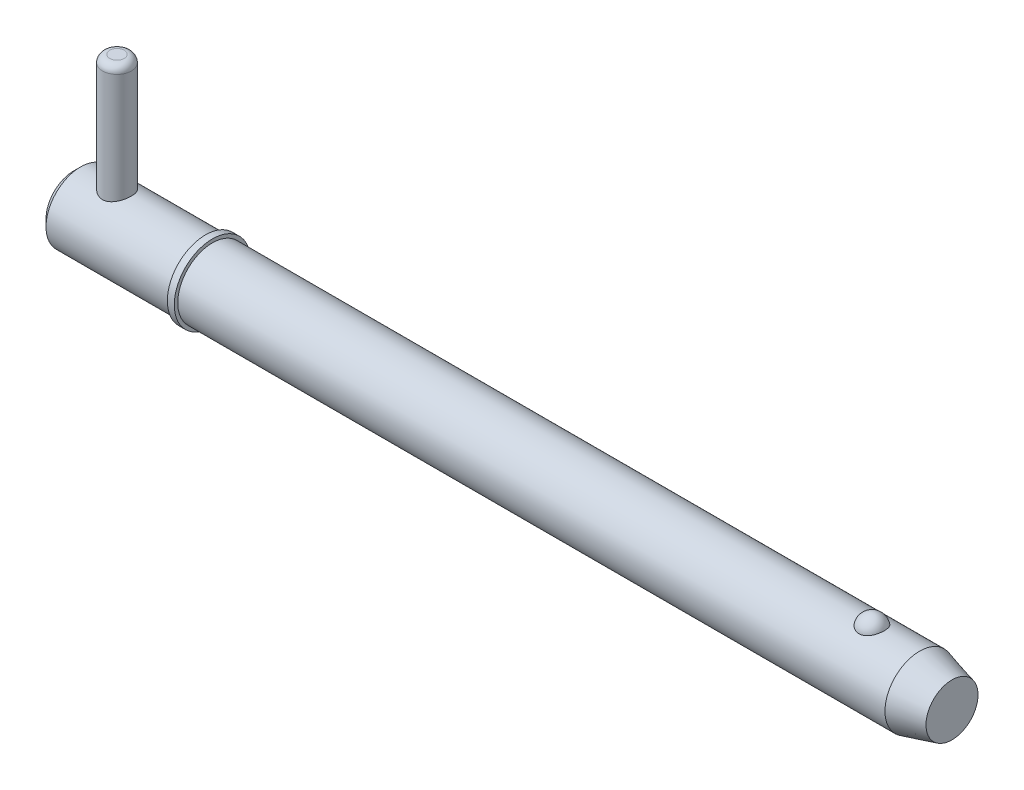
ISO-10303-21;
HEADER;
FILE_DESCRIPTION(('STEP AP214'),'2;1');
FILE_NAME('part.step','',(''),(''),'','','');
FILE_SCHEMA(('AUTOMOTIVE_DESIGN { 1 0 10303 214 1 1 1 1 }'));
ENDSEC;
DATA;
#1=APPLICATION_CONTEXT('core data for automotive mechanical design processes');
#2=APPLICATION_PROTOCOL_DEFINITION('international standard','automotive_design',2000,#1);
#3=PRODUCT_CONTEXT('',#1,'mechanical');
#4=PRODUCT('Part','Part','',(#3));
#5=PRODUCT_RELATED_PRODUCT_CATEGORY('part','',(#4));
#6=PRODUCT_DEFINITION_FORMATION('','',#4);
#7=PRODUCT_DEFINITION_CONTEXT('part definition',#1,'design');
#8=PRODUCT_DEFINITION('design','',#6,#7);
#9=PRODUCT_DEFINITION_SHAPE('','',#8);
#10=(LENGTH_UNIT() NAMED_UNIT(*) SI_UNIT(.MILLI.,.METRE.));
#11=(NAMED_UNIT(*) PLANE_ANGLE_UNIT() SI_UNIT($,.RADIAN.));
#12=(NAMED_UNIT(*) SI_UNIT($,.STERADIAN.) SOLID_ANGLE_UNIT());
#13=UNCERTAINTY_MEASURE_WITH_UNIT(LENGTH_MEASURE(1.E-05),#10,'distance_accuracy_value','');
#14=(GEOMETRIC_REPRESENTATION_CONTEXT(3) GLOBAL_UNCERTAINTY_ASSIGNED_CONTEXT((#13)) GLOBAL_UNIT_ASSIGNED_CONTEXT((#10,
#11,#12)) REPRESENTATION_CONTEXT('',''));
#15=CARTESIAN_POINT('',(0.,0.,0.));
#16=DIRECTION('',(0.,0.,1.));
#17=DIRECTION('',(1.,0.,0.));
#18=AXIS2_PLACEMENT_3D('',#15,#16,#17);
#19=CARTESIAN_POINT('',(5.94,20.635,0.));
#20=DIRECTION('',(0.,-1.,0.));
#21=DIRECTION('',(0.,0.,-1.));
#22=AXIS2_PLACEMENT_3D('',#19,#20,#21);
#23=CYLINDRICAL_SURFACE('',#22,1.98);
#24=CARTESIAN_POINT('',(5.94,-3.775,0.));
#25=DIRECTION('',(0.,1.,0.));
#26=DIRECTION('',(0.,0.,1.));
#27=AXIS2_PLACEMENT_3D('',#24,#25,#26);
#28=CIRCLE('',#27,1.98);
#29=CARTESIAN_POINT('',(5.94,-3.775,1.98));
#30=VERTEX_POINT('',#29);
#31=EDGE_CURVE('P0_E25',#30,#30,#28,.T.);
#32=ORIENTED_EDGE('',*,*,#31,.T.);
#33=EDGE_LOOP('',(#32));
#34=FACE_BOUND('',#33,.T.);
#35=CARTESIAN_POINT('',(5.94,19.645,0.));
#36=DIRECTION('',(0.,1.,0.));
#37=DIRECTION('',(0.,0.,1.));
#38=AXIS2_PLACEMENT_3D('',#35,#36,#37);
#39=CIRCLE('',#38,1.98);
#40=CARTESIAN_POINT('',(5.94,19.645,1.98));
#41=VERTEX_POINT('',#40);
#42=EDGE_CURVE('P0_E29',#41,#41,#39,.F.);
#43=ORIENTED_EDGE('',*,*,#42,.T.);
#44=EDGE_LOOP('',(#43));
#45=FACE_BOUND('',#44,.T.);
#46=ADVANCED_FACE('P0_F14',(#34,#45),#23,.T.);
#47=CARTESIAN_POINT('',(5.94,20.635,0.));
#48=DIRECTION('',(0.,1.,0.));
#49=DIRECTION('',(0.,0.,1.));
#50=AXIS2_PLACEMENT_3D('',#47,#48,#49);
#51=PLANE('',#50);
#52=CARTESIAN_POINT('',(5.94,20.635,0.));
#53=DIRECTION('',(0.,1.,0.));
#54=DIRECTION('',(0.,0.,1.));
#55=AXIS2_PLACEMENT_3D('',#52,#53,#54);
#56=CIRCLE('',#55,0.99);
#57=CARTESIAN_POINT('',(5.94,20.635,0.99));
#58=VERTEX_POINT('',#57);
#59=EDGE_CURVE('P0_E10',#58,#58,#56,.T.);
#60=ORIENTED_EDGE('',*,*,#59,.T.);
#61=EDGE_LOOP('',(#60));
#62=FACE_BOUND('',#61,.T.);
#63=ADVANCED_FACE('P0_F46',(#62),#51,.T.);
#64=CARTESIAN_POINT('',(5.94,-4.765,0.));
#65=DIRECTION('',(0.,1.,0.));
#66=DIRECTION('',(0.,0.,1.));
#67=AXIS2_PLACEMENT_3D('',#64,#65,#66);
#68=PLANE('',#67);
#69=CARTESIAN_POINT('',(5.94,-4.765,0.));
#70=DIRECTION('',(0.,1.,0.));
#71=DIRECTION('',(0.,0.,1.));
#72=AXIS2_PLACEMENT_3D('',#69,#70,#71);
#73=CIRCLE('',#72,0.99);
#74=CARTESIAN_POINT('',(5.94,-4.765,0.99));
#75=VERTEX_POINT('',#74);
#76=EDGE_CURVE('P0_E21',#75,#75,#73,.F.);
#77=ORIENTED_EDGE('',*,*,#76,.T.);
#78=EDGE_LOOP('',(#77));
#79=FACE_BOUND('',#78,.T.);
#80=ADVANCED_FACE('P0_F43',(#79),#68,.F.);
#81=CARTESIAN_POINT('',(5.94,-3.775,0.));
#82=DIRECTION('',(0.,1.,0.));
#83=DIRECTION('',(0.,0.,1.));
#84=AXIS2_PLACEMENT_3D('',#81,#82,#83);
#85=DEGENERATE_TOROIDAL_SURFACE('',#84,0.99,0.99,.T.);
#86=ORIENTED_EDGE('',*,*,#76,.F.);
#87=EDGE_LOOP('',(#86));
#88=FACE_BOUND('',#87,.T.);
#89=ORIENTED_EDGE('',*,*,#31,.F.);
#90=EDGE_LOOP('',(#89));
#91=FACE_BOUND('',#90,.T.);
#92=ADVANCED_FACE('P0_F38',(#88,#91),#85,.T.);
#93=CARTESIAN_POINT('',(5.94,19.645,0.));
#94=DIRECTION('',(0.,1.,0.));
#95=DIRECTION('',(0.,0.,1.));
#96=AXIS2_PLACEMENT_3D('',#93,#94,#95);
#97=DEGENERATE_TOROIDAL_SURFACE('',#96,0.99,0.99,.T.);
#98=ORIENTED_EDGE('',*,*,#42,.F.);
#99=EDGE_LOOP('',(#98));
#100=FACE_BOUND('',#99,.T.);
#101=ORIENTED_EDGE('',*,*,#59,.F.);
#102=EDGE_LOOP('',(#101));
#103=FACE_BOUND('',#102,.T.);
#104=ADVANCED_FACE('P0_F16',(#100,#103),#97,.T.);
#105=CLOSED_SHELL('',(#46,#63,#80,#92,#104));
#106=MANIFOLD_SOLID_BREP('P0_B1',#105);
#107=CARTESIAN_POINT('',(0.,0.,0.));
#108=DIRECTION('',(1.,0.,0.));
#109=DIRECTION('',(0.,0.,-1.));
#110=AXIS2_PLACEMENT_3D('',#107,#108,#109);
#111=CYLINDRICAL_SURFACE('',#110,4.765);
#112=CARTESIAN_POINT('',(116.204194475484,0.,0.));
#113=DIRECTION('',(1.,0.,0.));
#114=DIRECTION('',(0.,0.,-1.));
#115=AXIS2_PLACEMENT_3D('',#112,#113,#114);
#116=CIRCLE('',#115,4.765);
#117=CARTESIAN_POINT('',(116.204194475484,0.,-4.765));
#118=VERTEX_POINT('',#117);
#119=EDGE_CURVE('P1_E81',#118,#118,#116,.T.);
#120=ORIENTED_EDGE('',*,*,#119,.F.);
#121=EDGE_LOOP('',(#120));
#122=FACE_BOUND('',#121,.T.);
#123=CARTESIAN_POINT('',(19.05,0.,0.));
#124=DIRECTION('',(1.,0.,0.));
#125=DIRECTION('',(0.,0.,-1.));
#126=AXIS2_PLACEMENT_3D('',#123,#124,#125);
#127=CIRCLE('',#126,4.765);
#128=CARTESIAN_POINT('',(19.05,0.,-4.765));
#129=VERTEX_POINT('',#128);
#130=EDGE_CURVE('P1_E85',#129,#129,#127,.T.);
#131=ORIENTED_EDGE('',*,*,#130,.T.);
#132=EDGE_LOOP('',(#131));
#133=FACE_BOUND('',#132,.T.);
#134=CARTESIAN_POINT('',(109.651020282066,4.42764777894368,1.76101111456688));
#135=CARTESIAN_POINT('',(109.559721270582,4.42764470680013,1.76101422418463));
#136=CARTESIAN_POINT('',(109.468446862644,4.43059091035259,1.75366340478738));
#137=CARTESIAN_POINT('',(109.288615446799,4.44201846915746,1.72451180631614));
#138=CARTESIAN_POINT('',(109.200057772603,4.45049845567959,1.70271460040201));
#139=CARTESIAN_POINT('',(109.028257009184,4.47200516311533,1.6453937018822));
#140=CARTESIAN_POINT('',(108.945006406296,4.48502527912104,1.60988994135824));
#141=CARTESIAN_POINT('',(108.785763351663,4.51419542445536,1.52617873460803));
#142=CARTESIAN_POINT('',(108.709772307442,4.53034605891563,1.47796883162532));
#143=CARTESIAN_POINT('',(108.564744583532,4.5645931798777,1.36860494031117));
#144=CARTESIAN_POINT('',(108.495964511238,4.58273170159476,1.30712420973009));
#145=CARTESIAN_POINT('',(108.369342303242,4.61870302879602,1.17370204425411));
#146=CARTESIAN_POINT('',(108.311502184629,4.63653577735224,1.10175868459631));
#147=CARTESIAN_POINT('',(108.205570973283,4.67090140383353,0.945806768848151));
#148=CARTESIAN_POINT('',(108.158030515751,4.68734068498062,0.861402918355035));
#149=CARTESIAN_POINT('',(108.077081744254,4.71628466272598,0.685442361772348));
#150=CARTESIAN_POINT('',(108.043674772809,4.72878898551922,0.593884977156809));
#151=CARTESIAN_POINT('',(107.991287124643,4.74874061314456,0.404781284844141));
#152=CARTESIAN_POINT('',(107.972517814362,4.75611366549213,0.307168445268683));
#153=CARTESIAN_POINT('',(107.950584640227,4.76475393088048,0.109940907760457));
#154=CARTESIAN_POINT('',(107.947420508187,4.76602124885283,0.0103262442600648));
#155=CARTESIAN_POINT('',(107.956740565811,4.76232928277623,-0.187629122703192));
#156=CARTESIAN_POINT('',(107.969158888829,4.7573962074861,-0.285973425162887));
#157=CARTESIAN_POINT('',(108.009280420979,4.74184975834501,-0.479027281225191));
#158=CARTESIAN_POINT('',(108.036983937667,4.7312362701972,-0.573736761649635));
#159=CARTESIAN_POINT('',(108.107158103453,4.70540026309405,-0.756973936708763));
#160=CARTESIAN_POINT('',(108.149646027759,4.69017235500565,-0.845494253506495));
#161=CARTESIAN_POINT('',(108.248520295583,4.6566986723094,-1.01378033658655));
#162=CARTESIAN_POINT('',(108.304907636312,4.63845268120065,-1.09354547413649));
#163=CARTESIAN_POINT('',(108.430552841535,4.60085438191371,-1.24228523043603));
#164=CARTESIAN_POINT('',(108.499843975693,4.58149930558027,-1.31123108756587));
#165=CARTESIAN_POINT('',(108.649606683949,4.54391653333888,-1.43607409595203));
#166=CARTESIAN_POINT('',(108.730077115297,4.52568872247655,-1.49197257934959));
#167=CARTESIAN_POINT('',(108.898150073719,4.49293007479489,-1.58786764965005));
#168=CARTESIAN_POINT('',(108.985544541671,4.47832346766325,-1.62820219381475));
#169=CARTESIAN_POINT('',(109.166553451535,4.45406011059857,-1.69345757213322));
#170=CARTESIAN_POINT('',(109.26016555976,4.44440151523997,-1.71838415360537));
#171=CARTESIAN_POINT('',(109.445893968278,4.43159888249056,-1.75112843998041));
#172=CARTESIAN_POINT('',(109.537849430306,4.42815213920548,-1.75974223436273));
#173=CARTESIAN_POINT('',(109.721965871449,4.427247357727,-1.76201865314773));
#174=CARTESIAN_POINT('',(109.814126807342,4.42978816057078,-1.7556841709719));
#175=CARTESIAN_POINT('',(109.993129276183,4.4403864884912,-1.72869560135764));
#176=CARTESIAN_POINT('',(110.080047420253,4.44827555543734,-1.70847853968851));
#177=CARTESIAN_POINT('',(110.249131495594,4.46852246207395,-1.65479562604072));
#178=CARTESIAN_POINT('',(110.331297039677,4.48088066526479,-1.62132869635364));
#179=CARTESIAN_POINT('',(110.490591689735,4.50907357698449,-1.54120560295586));
#180=CARTESIAN_POINT('',(110.567570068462,4.52497884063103,-1.49427526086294));
#181=CARTESIAN_POINT('',(110.712708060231,4.55845148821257,-1.38881222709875));
#182=CARTESIAN_POINT('',(110.780865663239,4.57601924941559,-1.33027689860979));
#183=CARTESIAN_POINT('',(110.910099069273,4.61196537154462,-1.19991049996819));
#184=CARTESIAN_POINT('',(110.970656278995,4.63034074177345,-1.12756415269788));
#185=CARTESIAN_POINT('',(111.079279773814,4.66513959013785,-0.973612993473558));
#186=CARTESIAN_POINT('',(111.127343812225,4.68156271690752,-0.892006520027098));
#187=CARTESIAN_POINT('',(111.211383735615,4.71130224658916,-0.718892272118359));
#188=CARTESIAN_POINT('',(111.246918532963,4.724501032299,-0.627149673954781));
#189=CARTESIAN_POINT('',(111.302952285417,4.74571823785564,-0.438611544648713));
#190=CARTESIAN_POINT('',(111.323450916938,4.75373654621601,-0.341815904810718));
#191=CARTESIAN_POINT('',(111.349033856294,4.76378905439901,-0.145633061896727));
#192=CARTESIAN_POINT('',(111.354076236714,4.76580697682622,-0.0462395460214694));
#193=CARTESIAN_POINT('',(111.348523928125,4.76360573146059,0.152038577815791));
#194=CARTESIAN_POINT('',(111.337929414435,4.75938663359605,0.250923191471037));
#195=CARTESIAN_POINT('',(111.301387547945,4.74516937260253,0.445004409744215));
#196=CARTESIAN_POINT('',(111.275496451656,4.73519238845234,0.540213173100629));
#197=CARTESIAN_POINT('',(111.208927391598,4.7104939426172,0.724662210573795));
#198=CARTESIAN_POINT('',(111.168248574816,4.69577220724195,0.813902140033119));
#199=CARTESIAN_POINT('',(111.072717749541,4.66303767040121,0.984313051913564));
#200=CARTESIAN_POINT('',(111.017804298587,4.64501070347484,1.06544688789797));
#201=CARTESIAN_POINT('',(110.895049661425,4.60764678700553,1.21692673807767));
#202=CARTESIAN_POINT('',(110.827208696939,4.58830985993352,1.2872729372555));
#203=CARTESIAN_POINT('',(110.680548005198,4.55060370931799,1.41479271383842));
#204=CARTESIAN_POINT('',(110.601791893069,4.53222967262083,1.4720378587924));
#205=CARTESIAN_POINT('',(110.434989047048,4.49849576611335,1.57212016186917));
#206=CARTESIAN_POINT('',(110.346941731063,4.48313608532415,1.61495641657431));
#207=CARTESIAN_POINT('',(110.159791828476,4.45676184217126,1.68642657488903));
#208=CARTESIAN_POINT('',(110.060365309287,4.44598302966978,1.71430590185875));
#209=CARTESIAN_POINT('',(109.857621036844,4.43142918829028,1.75159258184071));
#210=CARTESIAN_POINT('',(109.754304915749,4.42765125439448,1.76100759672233));
#211=CARTESIAN_POINT('',(109.651020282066,4.42764777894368,1.76101111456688));
#212=B_SPLINE_CURVE_WITH_KNOTS('',3,(#134,#135,#136,#137,#138,#139,#140,#141,#142,#143,#144,
#145,#146,#147,#148,#149,#150,#151,#152,#153,#154,#155,#156,#157,#158,#159,#160,#161,#162,#163,
#164,#165,#166,#167,#168,#169,#170,#171,#172,#173,#174,#175,#176,#177,#178,#179,#180,#181,#182,
#183,#184,#185,#186,#187,#188,#189,#190,#191,#192,#193,#194,#195,#196,#197,#198,#199,#200,#201,
#202,#203,#204,#205,#206,#207,#208,#209,#210,#211),.UNSPECIFIED.,.T.,.F.,(4,2,2,2,2,2,2,2,2,2,2,
2,2,2,2,2,2,2,2,2,2,2,2,2,2,2,2,2,2,2,2,2,2,2,2,2,2,2,4),(0.,0.273517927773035,
0.546968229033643,0.820022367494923,1.09312934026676,1.37393946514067,1.65480131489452,
1.94820420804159,2.24163496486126,2.53922817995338,2.8368162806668,3.13315071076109,
3.42949110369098,3.72617893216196,4.02288805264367,4.32037303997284,4.61782764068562,
4.90840095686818,5.19886582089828,5.4747485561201,5.75057789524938,6.01809977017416,
6.2856434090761,6.55907787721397,6.83257454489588,7.11962987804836,7.40673679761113,
7.70312663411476,7.99952284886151,8.29672237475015,8.59391856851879,8.89002850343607,
9.18615552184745,9.483582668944,9.78100471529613,10.0767610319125,10.3725358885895,
10.6820893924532,10.991514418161),.UNSPECIFIED.);
#213=CARTESIAN_POINT('',(109.651020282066,4.42764777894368,1.76101111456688));
#214=VERTEX_POINT('',#213);
#215=EDGE_CURVE('P1_E35',#214,#214,#212,.T.);
#216=ORIENTED_EDGE('',*,*,#215,.T.);
#217=EDGE_LOOP('',(#216));
#218=FACE_BOUND('',#217,.T.);
#219=ADVANCED_FACE('P1_F13',(#122,#133,#218),#111,.T.);
#220=CARTESIAN_POINT('',(0.,0.,0.));
#221=DIRECTION('',(-1.,0.,0.));
#222=DIRECTION('',(0.,0.,1.));
#223=AXIS2_PLACEMENT_3D('',#220,#221,#222);
#224=PLANE('',#223);
#225=CARTESIAN_POINT('',(0.,0.,0.));
#226=DIRECTION('',(1.,0.,0.));
#227=DIRECTION('',(0.,0.,-1.));
#228=AXIS2_PLACEMENT_3D('',#225,#226,#227);
#229=CIRCLE('',#228,3.812);
#230=CARTESIAN_POINT('',(0.,0.,-3.812));
#231=VERTEX_POINT('',#230);
#232=EDGE_CURVE('P1_E9',#231,#231,#229,.T.);
#233=ORIENTED_EDGE('',*,*,#232,.F.);
#234=EDGE_LOOP('',(#233));
#235=FACE_BOUND('',#234,.T.);
#236=ADVANCED_FACE('P1_F15',(#235),#224,.T.);
#237=CARTESIAN_POINT('',(0.952999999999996,0.,0.));
#238=DIRECTION('',(1.,0.,0.));
#239=DIRECTION('',(0.,0.,-1.));
#240=AXIS2_PLACEMENT_3D('',#237,#238,#239);
#241=CONICAL_SURFACE('',#240,4.765,0.78539816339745);
#242=ORIENTED_EDGE('',*,*,#232,.T.);
#243=EDGE_LOOP('',(#242));
#244=FACE_BOUND('',#243,.T.);
#245=CARTESIAN_POINT('',(0.952999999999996,0.,0.));
#246=DIRECTION('',(1.,0.,0.));
#247=DIRECTION('',(0.,0.,-1.));
#248=AXIS2_PLACEMENT_3D('',#245,#246,#247);
#249=CIRCLE('',#248,4.765);
#250=CARTESIAN_POINT('',(0.952999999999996,0.,-4.765));
#251=VERTEX_POINT('',#250);
#252=EDGE_CURVE('P1_E26',#251,#251,#249,.T.);
#253=ORIENTED_EDGE('',*,*,#252,.F.);
#254=EDGE_LOOP('',(#253));
#255=FACE_BOUND('',#254,.T.);
#256=ADVANCED_FACE('P1_F77',(#244,#255),#241,.T.);
#257=CARTESIAN_POINT('',(0.,0.,0.));
#258=DIRECTION('',(1.,0.,0.));
#259=DIRECTION('',(0.,0.,-1.));
#260=AXIS2_PLACEMENT_3D('',#257,#258,#259);
#261=CYLINDRICAL_SURFACE('',#260,4.765);
#262=CARTESIAN_POINT('',(5.94,-4.33414639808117,1.98));
#263=CARTESIAN_POINT('',(5.83435484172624,-4.33415447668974,1.97999169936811));
#264=CARTESIAN_POINT('',(5.72854887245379,-4.33806396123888,1.97149330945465));
#265=CARTESIAN_POINT('',(5.51998191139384,-4.35319906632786,1.93783487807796));
#266=CARTESIAN_POINT('',(5.41723000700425,-4.3644446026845,1.91262947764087));
#267=CARTESIAN_POINT('',(5.21817294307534,-4.39274225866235,1.84670269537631));
#268=CARTESIAN_POINT('',(5.12184344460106,-4.40977076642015,1.80604432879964));
#269=CARTESIAN_POINT('',(4.93740039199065,-4.44768106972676,1.71055160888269));
#270=CARTESIAN_POINT('',(4.84928487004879,-4.46856193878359,1.65572066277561));
#271=CARTESIAN_POINT('',(4.67826533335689,-4.51326966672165,1.52981120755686));
#272=CARTESIAN_POINT('',(4.59593118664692,-4.53719608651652,1.45799365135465));
#273=CARTESIAN_POINT('',(4.44405452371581,-4.58448035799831,1.30170177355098));
#274=CARTESIAN_POINT('',(4.37451692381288,-4.60783798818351,1.21722260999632));
#275=CARTESIAN_POINT('',(4.24730683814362,-4.65256187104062,1.03353484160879));
#276=CARTESIAN_POINT('',(4.19027484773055,-4.67379892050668,0.933848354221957));
#277=CARTESIAN_POINT('',(4.0940363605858,-4.7106711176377,0.7252544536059));
#278=CARTESIAN_POINT('',(4.05482199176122,-4.72630873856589,0.61635113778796));
#279=CARTESIAN_POINT('',(3.99739515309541,-4.74951416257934,0.398397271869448));
#280=CARTESIAN_POINT('',(3.97820018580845,-4.7574579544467,0.289646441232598));
#281=CARTESIAN_POINT('',(3.95818309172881,-4.76574596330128,0.0701967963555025));
#282=CARTESIAN_POINT('',(3.95735355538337,-4.76609324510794,-0.0405012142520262));
#283=CARTESIAN_POINT('',(3.9735743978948,-4.75937098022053,-0.253561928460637));
#284=CARTESIAN_POINT('',(3.98954548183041,-4.75274912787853,-0.356023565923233));
#285=CARTESIAN_POINT('',(4.03706504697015,-4.73344665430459,-0.556659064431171));
#286=CARTESIAN_POINT('',(4.06861467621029,-4.72076558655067,-0.654832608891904));
#287=CARTESIAN_POINT('',(4.14677192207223,-4.69032846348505,-0.845904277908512));
#288=CARTESIAN_POINT('',(4.19360181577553,-4.67249797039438,-0.938699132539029));
#289=CARTESIAN_POINT('',(4.30077315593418,-4.63350852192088,-1.11535616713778));
#290=CARTESIAN_POINT('',(4.3611193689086,-4.61234839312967,-1.19921518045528));
#291=CARTESIAN_POINT('',(4.49853487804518,-4.56707259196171,-1.3618711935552));
#292=CARTESIAN_POINT('',(4.57648039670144,-4.5428537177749,-1.43990029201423));
#293=CARTESIAN_POINT('',(4.74440779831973,-4.49530722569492,-1.58211009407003));
#294=CARTESIAN_POINT('',(4.83439425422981,-4.47197995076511,-1.64628551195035));
#295=CARTESIAN_POINT('',(5.02755026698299,-4.42812342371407,-1.76092221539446));
#296=CARTESIAN_POINT('',(5.13105348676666,-4.40770990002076,-1.81086937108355));
#297=CARTESIAN_POINT('',(5.34607555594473,-4.37336901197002,-1.89231211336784));
#298=CARTESIAN_POINT('',(5.45758864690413,-4.3594370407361,-1.92382080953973));
#299=CARTESIAN_POINT('',(5.67777275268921,-4.34077746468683,-1.96554536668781));
#300=CARTESIAN_POINT('',(5.78616167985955,-4.33551319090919,-1.9770057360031));
#301=CARTESIAN_POINT('',(6.00341835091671,-4.33325118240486,-1.98196183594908));
#302=CARTESIAN_POINT('',(6.11228591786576,-4.33625061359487,-1.97546372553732));
#303=CARTESIAN_POINT('',(6.32012423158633,-4.34962383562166,-1.94582288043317));
#304=CARTESIAN_POINT('',(6.41928436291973,-4.35951709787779,-1.92376364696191));
#305=CARTESIAN_POINT('',(6.61241543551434,-4.38495043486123,-1.86506038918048));
#306=CARTESIAN_POINT('',(6.70638516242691,-4.40049182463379,-1.82841296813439));
#307=CARTESIAN_POINT('',(6.89090272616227,-4.43627016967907,-1.73985559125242));
#308=CARTESIAN_POINT('',(6.98113841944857,-4.45667771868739,-1.68736639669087));
#309=CARTESIAN_POINT('',(7.1519532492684,-4.49964530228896,-1.56919282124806));
#310=CARTESIAN_POINT('',(7.232528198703,-4.52220626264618,-1.50350275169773));
#311=CARTESIAN_POINT('',(7.38851617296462,-4.56914071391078,-1.35452895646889));
#312=CARTESIAN_POINT('',(7.46298462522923,-4.5935132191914,-1.27025197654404));
#313=CARTESIAN_POINT('',(7.59689029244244,-4.63962841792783,-1.08983181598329));
#314=CARTESIAN_POINT('',(7.65632644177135,-4.66137092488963,-0.993687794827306));
#315=CARTESIAN_POINT('',(7.75840361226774,-4.69991192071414,-0.791608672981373));
#316=CARTESIAN_POINT('',(7.80100481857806,-4.71669866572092,-0.685651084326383));
#317=CARTESIAN_POINT('',(7.86746997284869,-4.74331408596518,-0.467197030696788));
#318=CARTESIAN_POINT('',(7.8913450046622,-4.75314687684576,-0.354704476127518));
#319=CARTESIAN_POINT('',(7.91828971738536,-4.76427543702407,-0.134819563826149));
#320=CARTESIAN_POINT('',(7.92269147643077,-4.76611762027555,-0.027616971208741));
#321=CARTESIAN_POINT('',(7.91414154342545,-4.76256684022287,0.185959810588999));
#322=CARTESIAN_POINT('',(7.90119286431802,-4.75717513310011,0.292334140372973));
#323=CARTESIAN_POINT('',(7.85926572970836,-4.74004856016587,0.497383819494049));
#324=CARTESIAN_POINT('',(7.83086647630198,-4.72854322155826,0.596198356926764));
#325=CARTESIAN_POINT('',(7.75947503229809,-4.70045111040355,0.787624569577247));
#326=CARTESIAN_POINT('',(7.71648006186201,-4.68386336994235,0.880235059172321));
#327=CARTESIAN_POINT('',(7.6149456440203,-4.64628321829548,1.06122875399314));
#328=CARTESIAN_POINT('',(7.55579211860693,-4.62512577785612,1.14923242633));
#329=CARTESIAN_POINT('',(7.42451813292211,-4.58091700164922,1.31443888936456));
#330=CARTESIAN_POINT('',(7.35239289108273,-4.5578649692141,1.39163767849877));
#331=CARTESIAN_POINT('',(7.19146107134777,-4.51050832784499,1.53847013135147));
#332=CARTESIAN_POINT('',(7.10185635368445,-4.48622440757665,1.60723941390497));
#333=CARTESIAN_POINT('',(6.91164948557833,-4.44076541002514,1.72888900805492));
#334=CARTESIAN_POINT('',(6.81104124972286,-4.41959206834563,1.78176046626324));
#335=CARTESIAN_POINT('',(6.60181953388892,-4.38318936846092,1.86953227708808));
#336=CARTESIAN_POINT('',(6.49325511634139,-4.3679267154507,1.90453365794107));
#337=CARTESIAN_POINT('',(6.32681512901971,-4.35102038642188,1.94268459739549));
#338=CARTESIAN_POINT('',(6.27079191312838,-4.34638447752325,1.953006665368));
#339=CARTESIAN_POINT('',(6.15793999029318,-4.33925923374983,1.96879053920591));
#340=CARTESIAN_POINT('',(6.10111188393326,-4.33676837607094,1.97425579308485));
#341=CARTESIAN_POINT('',(6.00947316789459,-4.33456308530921,1.97908711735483));
#342=CARTESIAN_POINT('',(5.97474528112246,-4.33414374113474,1.98000272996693));
#343=CARTESIAN_POINT('',(5.94,-4.33414639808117,1.98));
#344=B_SPLINE_CURVE_WITH_KNOTS('',3,(#262,#263,#264,#265,#266,#267,#268,#269,#270,#271,#272,
#273,#274,#275,#276,#277,#278,#279,#280,#281,#282,#283,#284,#285,#286,#287,#288,#289,#290,#291,
#292,#293,#294,#295,#296,#297,#298,#299,#300,#301,#302,#303,#304,#305,#306,#307,#308,#309,#310,
#311,#312,#313,#314,#315,#316,#317,#318,#319,#320,#321,#322,#323,#324,#325,#326,#327,#328,#329,
#330,#331,#332,#333,#334,#335,#336,#337,#338,#339,#340,#341,#342,#343),.UNSPECIFIED.,.T.,.F.,(4,
2,2,2,2,2,2,2,2,2,2,2,2,2,2,2,2,2,2,2,2,2,2,2,2,2,2,2,2,2,2,2,2,2,2,2,2,2,2,2,4),(0.,
0.316814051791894,0.634491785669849,0.950887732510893,1.2672076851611,1.60127705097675,
1.93547449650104,2.28407463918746,2.63252061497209,2.96292077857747,3.29318763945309,
3.60346227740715,3.91375978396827,4.22878888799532,4.54392926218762,4.88117914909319,
5.21855748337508,5.56691259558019,5.91501972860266,6.24062939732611,6.56612741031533,
6.87094948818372,7.17584258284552,7.49361276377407,7.81152017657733,8.15513975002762,
8.4987836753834,8.8432355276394,9.18748334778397,9.50777781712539,9.8280166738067,
10.1370037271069,10.4460496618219,10.7690461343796,11.0921619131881,11.4371238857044,
11.7822776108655,12.1254577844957,12.2967183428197,12.4678572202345,12.5720531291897),.UNSPECIFIED.);
#345=CARTESIAN_POINT('',(5.94,-4.33414639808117,1.98));
#346=VERTEX_POINT('',#345);
#347=EDGE_CURVE('P1_E17',#346,#346,#344,.T.);
#348=ORIENTED_EDGE('',*,*,#347,.F.);
#349=EDGE_LOOP('',(#348));
#350=FACE_BOUND('',#349,.T.);
#351=CARTESIAN_POINT('',(5.94,4.33414639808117,1.98));
#352=CARTESIAN_POINT('',(6.04564515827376,4.33415447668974,1.97999169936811));
#353=CARTESIAN_POINT('',(6.15145112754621,4.33806396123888,1.97149330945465));
#354=CARTESIAN_POINT('',(6.36001808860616,4.35319906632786,1.93783487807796));
#355=CARTESIAN_POINT('',(6.46276999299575,4.3644446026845,1.91262947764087));
#356=CARTESIAN_POINT('',(6.66182705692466,4.39274225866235,1.84670269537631));
#357=CARTESIAN_POINT('',(6.75815655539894,4.40977076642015,1.80604432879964));
#358=CARTESIAN_POINT('',(6.94259960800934,4.44768106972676,1.71055160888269));
#359=CARTESIAN_POINT('',(7.03071512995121,4.46856193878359,1.65572066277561));
#360=CARTESIAN_POINT('',(7.20173466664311,4.51326966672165,1.52981120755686));
#361=CARTESIAN_POINT('',(7.28406881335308,4.53719608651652,1.45799365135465));
#362=CARTESIAN_POINT('',(7.43594547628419,4.58448035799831,1.30170177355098));
#363=CARTESIAN_POINT('',(7.50548307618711,4.60783798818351,1.21722260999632));
#364=CARTESIAN_POINT('',(7.63269316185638,4.65256187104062,1.03353484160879));
#365=CARTESIAN_POINT('',(7.68972515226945,4.67379892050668,0.933848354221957));
#366=CARTESIAN_POINT('',(7.7859636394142,4.7106711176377,0.7252544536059));
#367=CARTESIAN_POINT('',(7.82517800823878,4.72630873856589,0.61635113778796));
#368=CARTESIAN_POINT('',(7.88260484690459,4.74951416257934,0.398397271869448));
#369=CARTESIAN_POINT('',(7.90179981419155,4.7574579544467,0.289646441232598));
#370=CARTESIAN_POINT('',(7.92181690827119,4.76574596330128,0.0701967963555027));
#371=CARTESIAN_POINT('',(7.92264644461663,4.76609324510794,-0.040501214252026));
#372=CARTESIAN_POINT('',(7.9064256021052,4.75937098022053,-0.253561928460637));
#373=CARTESIAN_POINT('',(7.89045451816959,4.75274912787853,-0.356023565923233));
#374=CARTESIAN_POINT('',(7.84293495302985,4.73344665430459,-0.55665906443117));
#375=CARTESIAN_POINT('',(7.81138532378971,4.72076558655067,-0.654832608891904));
#376=CARTESIAN_POINT('',(7.73322807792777,4.69032846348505,-0.845904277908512));
#377=CARTESIAN_POINT('',(7.68639818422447,4.67249797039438,-0.938699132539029));
#378=CARTESIAN_POINT('',(7.57922684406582,4.63350852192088,-1.11535616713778));
#379=CARTESIAN_POINT('',(7.5188806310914,4.61234839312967,-1.19921518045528));
#380=CARTESIAN_POINT('',(7.38146512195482,4.56707259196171,-1.3618711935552));
#381=CARTESIAN_POINT('',(7.30351960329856,4.5428537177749,-1.43990029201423));
#382=CARTESIAN_POINT('',(7.13559220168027,4.49530722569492,-1.58211009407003));
#383=CARTESIAN_POINT('',(7.04560574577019,4.47197995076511,-1.64628551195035));
#384=CARTESIAN_POINT('',(6.85244973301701,4.42812342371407,-1.76092221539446));
#385=CARTESIAN_POINT('',(6.74894651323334,4.40770990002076,-1.81086937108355));
#386=CARTESIAN_POINT('',(6.53392444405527,4.37336901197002,-1.89231211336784));
#387=CARTESIAN_POINT('',(6.42241135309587,4.3594370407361,-1.92382080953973));
#388=CARTESIAN_POINT('',(6.20222724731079,4.34077746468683,-1.96554536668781));
#389=CARTESIAN_POINT('',(6.09383832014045,4.33551319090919,-1.9770057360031));
#390=CARTESIAN_POINT('',(5.87658164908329,4.33325118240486,-1.98196183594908));
#391=CARTESIAN_POINT('',(5.76771408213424,4.33625061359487,-1.97546372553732));
#392=CARTESIAN_POINT('',(5.55987576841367,4.34962383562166,-1.94582288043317));
#393=CARTESIAN_POINT('',(5.46071563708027,4.35951709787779,-1.92376364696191));
#394=CARTESIAN_POINT('',(5.26758456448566,4.38495043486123,-1.86506038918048));
#395=CARTESIAN_POINT('',(5.17361483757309,4.40049182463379,-1.82841296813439));
#396=CARTESIAN_POINT('',(4.98909727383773,4.43627016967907,-1.73985559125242));
#397=CARTESIAN_POINT('',(4.89886158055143,4.45667771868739,-1.68736639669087));
#398=CARTESIAN_POINT('',(4.72804675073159,4.49964530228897,-1.56919282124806));
#399=CARTESIAN_POINT('',(4.647471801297,4.52220626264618,-1.50350275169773));
#400=CARTESIAN_POINT('',(4.49148382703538,4.56914071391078,-1.35452895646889));
#401=CARTESIAN_POINT('',(4.41701537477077,4.5935132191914,-1.27025197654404));
#402=CARTESIAN_POINT('',(4.28310970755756,4.63962841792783,-1.08983181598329));
#403=CARTESIAN_POINT('',(4.22367355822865,4.66137092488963,-0.993687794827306));
#404=CARTESIAN_POINT('',(4.12159638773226,4.69991192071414,-0.791608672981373));
#405=CARTESIAN_POINT('',(4.07899518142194,4.71669866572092,-0.685651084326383));
#406=CARTESIAN_POINT('',(4.01253002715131,4.74331408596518,-0.467197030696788));
#407=CARTESIAN_POINT('',(3.98865499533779,4.75314687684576,-0.354704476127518));
#408=CARTESIAN_POINT('',(3.96171028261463,4.76427543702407,-0.134819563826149));
#409=CARTESIAN_POINT('',(3.95730852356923,4.76611762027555,-0.0276169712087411));
#410=CARTESIAN_POINT('',(3.96585845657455,4.76256684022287,0.185959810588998));
#411=CARTESIAN_POINT('',(3.97880713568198,4.75717513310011,0.292334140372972));
#412=CARTESIAN_POINT('',(4.02073427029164,4.74004856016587,0.497383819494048));
#413=CARTESIAN_POINT('',(4.04913352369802,4.72854322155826,0.596198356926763));
#414=CARTESIAN_POINT('',(4.12052496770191,4.70045111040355,0.787624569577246));
#415=CARTESIAN_POINT('',(4.16351993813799,4.68386336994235,0.880235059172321));
#416=CARTESIAN_POINT('',(4.2650543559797,4.64628321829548,1.06122875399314));
#417=CARTESIAN_POINT('',(4.32420788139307,4.62512577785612,1.14923242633));
#418=CARTESIAN_POINT('',(4.45548186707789,4.58091700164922,1.31443888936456));
#419=CARTESIAN_POINT('',(4.52760710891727,4.5578649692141,1.39163767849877));
#420=CARTESIAN_POINT('',(4.68853892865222,4.51050832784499,1.53847013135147));
#421=CARTESIAN_POINT('',(4.77814364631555,4.48622440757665,1.60723941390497));
#422=CARTESIAN_POINT('',(4.96835051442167,4.44076541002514,1.72888900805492));
#423=CARTESIAN_POINT('',(5.06895875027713,4.41959206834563,1.78176046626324));
#424=CARTESIAN_POINT('',(5.27818046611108,4.38318936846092,1.86953227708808));
#425=CARTESIAN_POINT('',(5.38674488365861,4.3679267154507,1.90453365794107));
#426=CARTESIAN_POINT('',(5.55318487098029,4.35102038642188,1.94268459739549));
#427=CARTESIAN_POINT('',(5.60920808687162,4.34638447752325,1.953006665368));
#428=CARTESIAN_POINT('',(5.72206000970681,4.33925923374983,1.96879053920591));
#429=CARTESIAN_POINT('',(5.77888811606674,4.33676837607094,1.97425579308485));
#430=CARTESIAN_POINT('',(5.87052683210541,4.33456308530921,1.97908711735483));
#431=CARTESIAN_POINT('',(5.90525471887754,4.33414374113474,1.98000272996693));
#432=CARTESIAN_POINT('',(5.94,4.33414639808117,1.98));
#433=B_SPLINE_CURVE_WITH_KNOTS('',3,(#351,#352,#353,#354,#355,#356,#357,#358,#359,#360,#361,
#362,#363,#364,#365,#366,#367,#368,#369,#370,#371,#372,#373,#374,#375,#376,#377,#378,#379,#380,
#381,#382,#383,#384,#385,#386,#387,#388,#389,#390,#391,#392,#393,#394,#395,#396,#397,#398,#399,
#400,#401,#402,#403,#404,#405,#406,#407,#408,#409,#410,#411,#412,#413,#414,#415,#416,#417,#418,
#419,#420,#421,#422,#423,#424,#425,#426,#427,#428,#429,#430,#431,#432),.UNSPECIFIED.,.T.,.F.,(4,
2,2,2,2,2,2,2,2,2,2,2,2,2,2,2,2,2,2,2,2,2,2,2,2,2,2,2,2,2,2,2,2,2,2,2,2,2,2,2,4),(0.,
0.316814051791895,0.634491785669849,0.950887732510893,1.2672076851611,1.60127705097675,
1.93547449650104,2.28407463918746,2.63252061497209,2.96292077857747,3.29318763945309,
3.60346227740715,3.91375978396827,4.22878888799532,4.54392926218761,4.88117914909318,
5.21855748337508,5.56691259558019,5.91501972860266,6.24062939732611,6.56612741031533,
6.87094948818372,7.17584258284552,7.49361276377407,7.81152017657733,8.15513975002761,
8.4987836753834,8.84323552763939,9.18748334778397,9.50777781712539,9.8280166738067,
10.1370037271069,10.4460496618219,10.7690461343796,11.0921619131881,11.4371238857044,
11.7822776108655,12.1254577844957,12.2967183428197,12.4678572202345,12.5720531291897),.UNSPECIFIED.);
#434=CARTESIAN_POINT('',(5.94,4.33414639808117,1.98));
#435=VERTEX_POINT('',#434);
#436=EDGE_CURVE('P1_E43',#435,#435,#433,.T.);
#437=ORIENTED_EDGE('',*,*,#436,.F.);
#438=EDGE_LOOP('',(#437));
#439=FACE_BOUND('',#438,.T.);
#440=ORIENTED_EDGE('',*,*,#252,.T.);
#441=EDGE_LOOP('',(#440));
#442=FACE_BOUND('',#441,.T.);
#443=CARTESIAN_POINT('',(18.097,0.,0.));
#444=DIRECTION('',(1.,0.,0.));
#445=DIRECTION('',(0.,0.,-1.));
#446=AXIS2_PLACEMENT_3D('',#443,#444,#445);
#447=CIRCLE('',#446,4.765);
#448=CARTESIAN_POINT('',(18.097,0.,-4.765));
#449=VERTEX_POINT('',#448);
#450=EDGE_CURVE('P1_E31',#449,#449,#447,.T.);
#451=ORIENTED_EDGE('',*,*,#450,.F.);
#452=EDGE_LOOP('',(#451));
#453=FACE_BOUND('',#452,.T.);
#454=ADVANCED_FACE('P1_F103',(#350,#439,#442,#453),#261,.T.);
#455=CARTESIAN_POINT('',(18.097,4.765,0.));
#456=DIRECTION('',(-1.,0.,0.));
#457=DIRECTION('',(0.,0.,1.));
#458=AXIS2_PLACEMENT_3D('',#455,#456,#457);
#459=PLANE('',#458);
#460=ORIENTED_EDGE('',*,*,#450,.T.);
#461=EDGE_LOOP('',(#460));
#462=FACE_BOUND('',#461,.T.);
#463=CARTESIAN_POINT('',(18.097,0.,0.));
#464=DIRECTION('',(1.,0.,0.));
#465=DIRECTION('',(0.,0.,-1.));
#466=AXIS2_PLACEMENT_3D('',#463,#464,#465);
#467=CIRCLE('',#466,5.2415);
#468=CARTESIAN_POINT('',(18.097,0.,-5.2415));
#469=VERTEX_POINT('',#468);
#470=EDGE_CURVE('P1_E91',#469,#469,#467,.T.);
#471=ORIENTED_EDGE('',*,*,#470,.F.);
#472=EDGE_LOOP('',(#471));
#473=FACE_BOUND('',#472,.T.);
#474=ADVANCED_FACE('P1_F100',(#462,#473),#459,.T.);
#475=CARTESIAN_POINT('',(0.,0.,0.));
#476=DIRECTION('',(1.,0.,0.));
#477=DIRECTION('',(0.,0.,-1.));
#478=AXIS2_PLACEMENT_3D('',#475,#476,#477);
#479=CYLINDRICAL_SURFACE('',#478,5.2415);
#480=ORIENTED_EDGE('',*,*,#470,.T.);
#481=EDGE_LOOP('',(#480));
#482=FACE_BOUND('',#481,.T.);
#483=CARTESIAN_POINT('',(19.05,0.,0.));
#484=DIRECTION('',(1.,0.,0.));
#485=DIRECTION('',(0.,0.,-1.));
#486=AXIS2_PLACEMENT_3D('',#483,#484,#485);
#487=CIRCLE('',#486,5.2415);
#488=CARTESIAN_POINT('',(19.05,0.,-5.2415));
#489=VERTEX_POINT('',#488);
#490=EDGE_CURVE('P1_E88',#489,#489,#487,.T.);
#491=ORIENTED_EDGE('',*,*,#490,.F.);
#492=EDGE_LOOP('',(#491));
#493=FACE_BOUND('',#492,.T.);
#494=ADVANCED_FACE('P1_F68',(#482,#493),#479,.T.);
#495=CARTESIAN_POINT('',(19.05,5.2415,0.));
#496=DIRECTION('',(1.,0.,0.));
#497=DIRECTION('',(0.,0.,-1.));
#498=AXIS2_PLACEMENT_3D('',#495,#496,#497);
#499=PLANE('',#498);
#500=ORIENTED_EDGE('',*,*,#490,.T.);
#501=EDGE_LOOP('',(#500));
#502=FACE_BOUND('',#501,.T.);
#503=ORIENTED_EDGE('',*,*,#130,.F.);
#504=EDGE_LOOP('',(#503));
#505=FACE_BOUND('',#504,.T.);
#506=ADVANCED_FACE('P1_F62',(#502,#505),#499,.T.);
#507=CARTESIAN_POINT('',(120.65,0.,0.));
#508=DIRECTION('',(-1.,0.,0.));
#509=DIRECTION('',(0.,0.,1.));
#510=AXIS2_PLACEMENT_3D('',#507,#508,#509);
#511=CONICAL_SURFACE('',#510,3.57375000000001,0.26179938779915);
#512=ORIENTED_EDGE('',*,*,#119,.T.);
#513=EDGE_LOOP('',(#512));
#514=FACE_BOUND('',#513,.T.);
#515=CARTESIAN_POINT('',(120.65,0.,0.));
#516=DIRECTION('',(1.,0.,0.));
#517=DIRECTION('',(0.,0.,-1.));
#518=AXIS2_PLACEMENT_3D('',#515,#516,#517);
#519=CIRCLE('',#518,3.57375000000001);
#520=CARTESIAN_POINT('',(120.65,0.,-3.57375000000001));
#521=VERTEX_POINT('',#520);
#522=EDGE_CURVE('P1_E42',#521,#521,#519,.T.);
#523=ORIENTED_EDGE('',*,*,#522,.F.);
#524=EDGE_LOOP('',(#523));
#525=FACE_BOUND('',#524,.T.);
#526=ADVANCED_FACE('P1_F59',(#514,#525),#511,.T.);
#527=CARTESIAN_POINT('',(120.65,3.57375000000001,0.));
#528=DIRECTION('',(1.,0.,0.));
#529=DIRECTION('',(0.,0.,-1.));
#530=AXIS2_PLACEMENT_3D('',#527,#528,#529);
#531=PLANE('',#530);
#532=ORIENTED_EDGE('',*,*,#522,.T.);
#533=EDGE_LOOP('',(#532));
#534=FACE_BOUND('',#533,.T.);
#535=ADVANCED_FACE('P1_F55',(#534),#531,.T.);
#536=CARTESIAN_POINT('',(109.651020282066,4.2885,0.));
#537=DIRECTION('',(-1.,0.,0.));
#538=DIRECTION('',(0.,1.,0.));
#539=AXIS2_PLACEMENT_3D('',#536,#537,#538);
#540=SPHERICAL_SURFACE('',#539,1.7665);
#541=ORIENTED_EDGE('',*,*,#215,.F.);
#542=EDGE_LOOP('',(#541));
#543=FACE_BOUND('',#542,.T.);
#544=ADVANCED_FACE('P1_F50',(#543),#540,.T.);
#545=CARTESIAN_POINT('',(5.94,-5.2415,0.));
#546=DIRECTION('',(0.,1.,0.));
#547=DIRECTION('',(0.,0.,1.));
#548=AXIS2_PLACEMENT_3D('',#545,#546,#547);
#549=CYLINDRICAL_SURFACE('',#548,1.98);
#550=ORIENTED_EDGE('',*,*,#347,.T.);
#551=EDGE_LOOP('',(#550));
#552=FACE_BOUND('',#551,.T.);
#553=ORIENTED_EDGE('',*,*,#436,.T.);
#554=EDGE_LOOP('',(#553));
#555=FACE_BOUND('',#554,.T.);
#556=ADVANCED_FACE('P1_F54',(#552,#555),#549,.F.);
#557=CLOSED_SHELL('',(#219,#236,#256,#454,#474,#494,#506,#526,#535,#544,#556));
#558=MANIFOLD_SOLID_BREP('P1_B1',#557);
#559=ADVANCED_BREP_SHAPE_REPRESENTATION('',(#18,#106,#558),#14);
#560=SHAPE_DEFINITION_REPRESENTATION(#9,#559);
ENDSEC;
END-ISO-10303-21;
